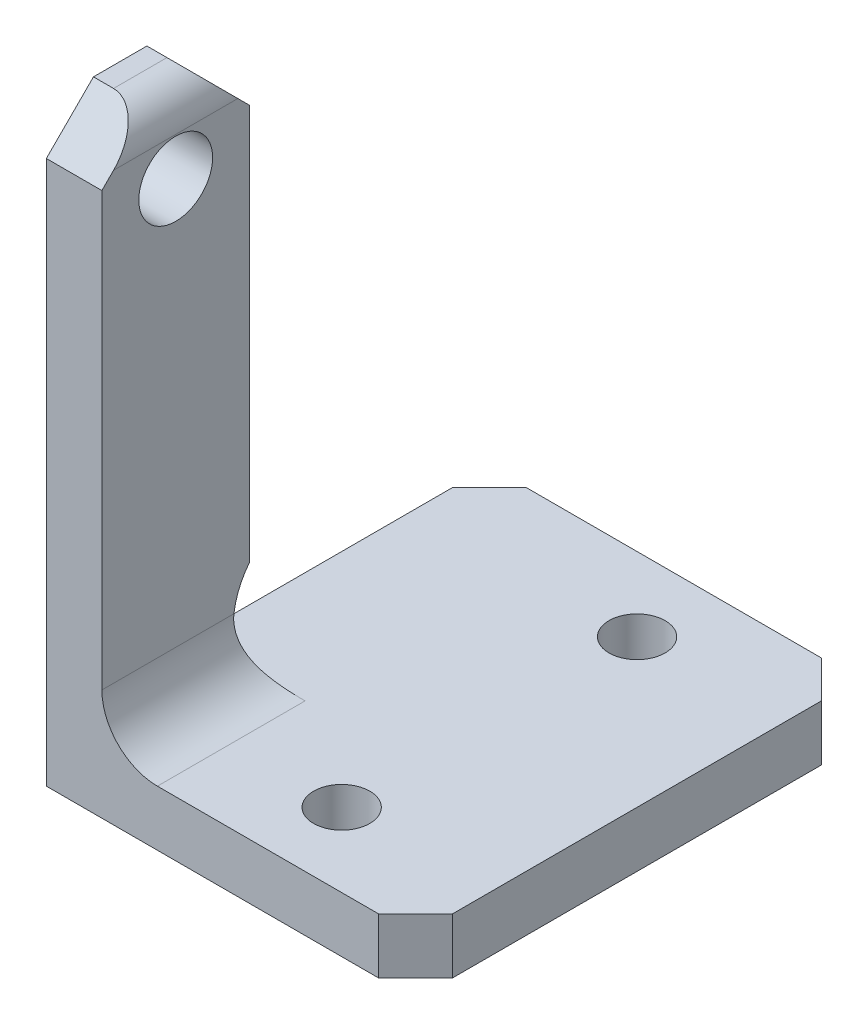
ISO-10303-21;
HEADER;
FILE_DESCRIPTION(('STEP AP214'),'2;1');
FILE_NAME('part.step','',(''),(''),'','','');
FILE_SCHEMA(('AUTOMOTIVE_DESIGN { 1 0 10303 214 1 1 1 1 }'));
ENDSEC;
DATA;
#1=APPLICATION_CONTEXT('core data for automotive mechanical design processes');
#2=APPLICATION_PROTOCOL_DEFINITION('international standard','automotive_design',2000,#1);
#3=PRODUCT_CONTEXT('',#1,'mechanical');
#4=PRODUCT('Part','Part','',(#3));
#5=PRODUCT_RELATED_PRODUCT_CATEGORY('part','',(#4));
#6=PRODUCT_DEFINITION_FORMATION('','',#4);
#7=PRODUCT_DEFINITION_CONTEXT('part definition',#1,'design');
#8=PRODUCT_DEFINITION('design','',#6,#7);
#9=PRODUCT_DEFINITION_SHAPE('','',#8);
#10=(LENGTH_UNIT() NAMED_UNIT(*) SI_UNIT(.MILLI.,.METRE.));
#11=(NAMED_UNIT(*) PLANE_ANGLE_UNIT() SI_UNIT($,.RADIAN.));
#12=(NAMED_UNIT(*) SI_UNIT($,.STERADIAN.) SOLID_ANGLE_UNIT());
#13=UNCERTAINTY_MEASURE_WITH_UNIT(LENGTH_MEASURE(1.E-05),#10,'distance_accuracy_value','');
#14=(GEOMETRIC_REPRESENTATION_CONTEXT(3) GLOBAL_UNCERTAINTY_ASSIGNED_CONTEXT((#13)) GLOBAL_UNIT_ASSIGNED_CONTEXT((#10,
#11,#12)) REPRESENTATION_CONTEXT('',''));
#15=CARTESIAN_POINT('',(0.,0.,0.));
#16=DIRECTION('',(0.,0.,1.));
#17=DIRECTION('',(1.,0.,0.));
#18=AXIS2_PLACEMENT_3D('',#15,#16,#17);
#19=CARTESIAN_POINT('',(-2.81025203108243E-13,0.,38.100000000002));
#20=DIRECTION('',(0.,1.,0.));
#21=DIRECTION('',(0.,0.,1.00000000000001));
#22=AXIS2_PLACEMENT_3D('',#19,#20,#21);
#23=PLANE('',#22);
#24=CARTESIAN_POINT('',(19.05,3.05311331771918E-13,31.7500000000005));
#25=DIRECTION('',(0.,1.,0.));
#26=DIRECTION('',(0.,0.,1.00000000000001));
#27=AXIS2_PLACEMENT_3D('',#24,#25,#26);
#28=CIRCLE('',#27,2.413);
#29=CARTESIAN_POINT('',(19.05,3.01797798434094E-13,34.1630000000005));
#30=VERTEX_POINT('',#29);
#31=EDGE_CURVE('E172',#30,#30,#28,.T.);
#32=ORIENTED_EDGE('',*,*,#31,.T.);
#33=EDGE_LOOP('',(#32));
#34=FACE_BOUND('',#33,.T.);
#35=CARTESIAN_POINT('',(19.0500000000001,0.,6.35000000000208));
#36=DIRECTION('',(0.,1.,0.));
#37=DIRECTION('',(0.,0.,1.00000000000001));
#38=AXIS2_PLACEMENT_3D('',#35,#36,#37);
#39=CIRCLE('',#38,2.413);
#40=CARTESIAN_POINT('',(19.0500000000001,0.,8.7630000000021));
#41=VERTEX_POINT('',#40);
#42=EDGE_CURVE('E178',#41,#41,#39,.T.);
#43=ORIENTED_EDGE('',*,*,#42,.T.);
#44=EDGE_LOOP('',(#43));
#45=FACE_BOUND('',#44,.T.);
#46=DIRECTION('',(0.,0.,-1.00000000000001));
#47=VECTOR('',#46,1.);
#48=CARTESIAN_POINT('',(-2.81025203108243E-13,0.,38.100000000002));
#49=LINE('',#48,#47);
#50=CARTESIAN_POINT('',(-2.81025203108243E-13,0.,38.100000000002));
#51=VERTEX_POINT('',#50);
#52=CARTESIAN_POINT('',(0.,-1.66533453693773E-13,3.17499999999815));
#53=VERTEX_POINT('',#52);
#54=EDGE_CURVE('E198',#51,#53,#49,.T.);
#55=ORIENTED_EDGE('',*,*,#54,.T.);
#56=DIRECTION('',(0.707106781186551,0.,-0.707106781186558));
#57=VECTOR('',#56,1.);
#58=CARTESIAN_POINT('',(0.,-1.66533453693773E-13,3.17499999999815));
#59=LINE('',#58,#57);
#60=CARTESIAN_POINT('',(3.17499999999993,0.,1.4432899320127E-12));
#61=VERTEX_POINT('',#60);
#62=EDGE_CURVE('E242',#53,#61,#59,.T.);
#63=ORIENTED_EDGE('',*,*,#62,.T.);
#64=DIRECTION('',(1.00000000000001,0.,0.));
#65=VECTOR('',#64,1.);
#66=CARTESIAN_POINT('',(0.,0.,1.11022302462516E-12));
#67=LINE('',#66,#65);
#68=CARTESIAN_POINT('',(28.575,1.11022302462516E-13,2.1094237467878E-12));
#69=VERTEX_POINT('',#68);
#70=EDGE_CURVE('E181',#61,#69,#67,.T.);
#71=ORIENTED_EDGE('',*,*,#70,.T.);
#72=DIRECTION('',(0.707106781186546,0.,0.707106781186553));
#73=VECTOR('',#72,1.);
#74=CARTESIAN_POINT('',(31.7500000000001,1.11022302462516E-13,3.17500000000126));
#75=LINE('',#74,#73);
#76=CARTESIAN_POINT('',(31.7500000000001,1.11022302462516E-13,3.17500000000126));
#77=VERTEX_POINT('',#76);
#78=EDGE_CURVE('E234',#69,#77,#75,.T.);
#79=ORIENTED_EDGE('',*,*,#78,.T.);
#80=DIRECTION('',(0.,0.,-1.00000000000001));
#81=VECTOR('',#80,1.);
#82=CARTESIAN_POINT('',(31.75,0.,38.1000000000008));
#83=LINE('',#82,#81);
#84=CARTESIAN_POINT('',(31.7499999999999,-1.11022302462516E-13,34.9250000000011));
#85=VERTEX_POINT('',#84);
#86=EDGE_CURVE('E217',#85,#77,#83,.T.);
#87=ORIENTED_EDGE('',*,*,#86,.F.);
#88=DIRECTION('',(0.707106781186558,0.,-0.707106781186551));
#89=VECTOR('',#88,1.);
#90=CARTESIAN_POINT('',(28.5749999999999,2.77555756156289E-13,38.1));
#91=LINE('',#90,#89);
#92=CARTESIAN_POINT('',(28.5749999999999,2.77555756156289E-13,38.1));
#93=VERTEX_POINT('',#92);
#94=EDGE_CURVE('E232',#85,#93,#91,.F.);
#95=ORIENTED_EDGE('',*,*,#94,.T.);
#96=DIRECTION('',(1.00000000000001,0.,0.));
#97=VECTOR('',#96,1.);
#98=CARTESIAN_POINT('',(-2.81025203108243E-13,0.,38.100000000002));
#99=LINE('',#98,#97);
#100=EDGE_CURVE('E186',#51,#93,#99,.T.);
#101=ORIENTED_EDGE('',*,*,#100,.F.);
#102=EDGE_LOOP('',(#55,#63,#71,#79,#87,#95,#101));
#103=FACE_BOUND('',#102,.T.);
#104=ADVANCED_FACE('F32',(#34,#45,#103),#23,.F.);
#105=CARTESIAN_POINT('',(31.75,4.77520000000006,38.1000000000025));
#106=DIRECTION('',(-1.00000000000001,0.,0.));
#107=DIRECTION('',(0.,0.,1.00000000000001));
#108=AXIS2_PLACEMENT_3D('',#105,#106,#107);
#109=PLANE('',#108);
#110=ORIENTED_EDGE('',*,*,#86,.T.);
#111=DIRECTION('',(0.,1.,0.));
#112=VECTOR('',#111,1.);
#113=CARTESIAN_POINT('',(31.7500000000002,4.77520000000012,3.17500000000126));
#114=LINE('',#113,#112);
#115=CARTESIAN_POINT('',(31.7500000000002,4.77520000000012,3.17500000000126));
#116=VERTEX_POINT('',#115);
#117=EDGE_CURVE('E222',#77,#116,#114,.T.);
#118=ORIENTED_EDGE('',*,*,#117,.T.);
#119=DIRECTION('',(0.,0.,-1.00000000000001));
#120=VECTOR('',#119,1.);
#121=CARTESIAN_POINT('',(31.75,4.77520000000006,38.1000000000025));
#122=LINE('',#121,#120);
#123=CARTESIAN_POINT('',(31.7500000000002,4.7751999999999,34.9250000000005));
#124=VERTEX_POINT('',#123);
#125=EDGE_CURVE('E215',#124,#116,#122,.T.);
#126=ORIENTED_EDGE('',*,*,#125,.F.);
#127=DIRECTION('',(0.,-1.,0.));
#128=VECTOR('',#127,1.);
#129=CARTESIAN_POINT('',(31.7500000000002,4.7751999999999,34.9250000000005));
#130=LINE('',#129,#128);
#131=EDGE_CURVE('E220',#124,#85,#130,.T.);
#132=ORIENTED_EDGE('',*,*,#131,.T.);
#133=EDGE_LOOP('',(#110,#118,#126,#132));
#134=FACE_BOUND('',#133,.T.);
#135=ADVANCED_FACE('F273',(#134),#109,.F.);
#136=CARTESIAN_POINT('',(9.55039999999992,4.7752000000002,38.0999999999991));
#137=DIRECTION('',(0.,-1.,0.));
#138=DIRECTION('',(0.,0.,-1.00000000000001));
#139=AXIS2_PLACEMENT_3D('',#136,#137,#138);
#140=PLANE('',#139);
#141=DIRECTION('',(1.00000000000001,0.,0.));
#142=VECTOR('',#141,1.);
#143=CARTESIAN_POINT('',(-1.49186218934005E-13,4.77519999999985,25.4000000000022));
#144=LINE('',#143,#142);
#145=CARTESIAN_POINT('',(0.,4.77519999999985,25.4000000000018));
#146=VERTEX_POINT('',#145);
#147=CARTESIAN_POINT('',(9.55039999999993,4.77520000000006,25.4000000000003));
#148=VERTEX_POINT('',#147);
#149=EDGE_CURVE('E142',#146,#148,#144,.T.);
#150=ORIENTED_EDGE('',*,*,#149,.T.);
#151=DIRECTION('',(0.,0.,-1.00000000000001));
#152=VECTOR('',#151,1.);
#153=CARTESIAN_POINT('',(9.55039999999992,4.7752000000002,38.0999999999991));
#154=LINE('',#153,#152);
#155=CARTESIAN_POINT('',(9.55039999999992,4.7752000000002,38.0999999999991));
#156=VERTEX_POINT('',#155);
#157=EDGE_CURVE('E212',#156,#148,#154,.T.);
#158=ORIENTED_EDGE('',*,*,#157,.F.);
#159=DIRECTION('',(-1.00000000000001,0.,0.));
#160=VECTOR('',#159,1.);
#161=CARTESIAN_POINT('',(9.55039999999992,4.7752000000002,38.0999999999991));
#162=LINE('',#161,#160);
#163=CARTESIAN_POINT('',(28.5749999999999,4.77520000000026,38.1000000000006));
#164=VERTEX_POINT('',#163);
#165=EDGE_CURVE('E189',#164,#156,#162,.T.);
#166=ORIENTED_EDGE('',*,*,#165,.F.);
#167=DIRECTION('',(-0.707106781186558,0.,0.707106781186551));
#168=VECTOR('',#167,1.);
#169=CARTESIAN_POINT('',(28.5749999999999,4.77520000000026,38.1000000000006));
#170=LINE('',#169,#168);
#171=EDGE_CURVE('E225',#164,#124,#170,.F.);
#172=ORIENTED_EDGE('',*,*,#171,.T.);
#173=ORIENTED_EDGE('',*,*,#125,.T.);
#174=DIRECTION('',(-0.707106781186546,0.,-0.707106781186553));
#175=VECTOR('',#174,1.);
#176=CARTESIAN_POINT('',(31.7500000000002,4.77520000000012,3.17500000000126));
#177=LINE('',#176,#175);
#178=CARTESIAN_POINT('',(28.5750000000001,4.77520000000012,2.33146835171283E-12));
#179=VERTEX_POINT('',#178);
#180=EDGE_CURVE('E227',#116,#179,#177,.T.);
#181=ORIENTED_EDGE('',*,*,#180,.T.);
#182=DIRECTION('',(-1.00000000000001,0.,0.));
#183=VECTOR('',#182,1.);
#184=CARTESIAN_POINT('',(9.55040000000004,4.77520000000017,1.55431223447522E-12));
#185=LINE('',#184,#183);
#186=CARTESIAN_POINT('',(3.17499999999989,4.77520000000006,1.11022302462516E-12));
#187=VERTEX_POINT('',#186);
#188=EDGE_CURVE('E183',#179,#187,#185,.T.);
#189=ORIENTED_EDGE('',*,*,#188,.T.);
#190=DIRECTION('',(-0.707106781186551,0.,0.707106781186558));
#191=VECTOR('',#190,1.);
#192=CARTESIAN_POINT('',(-1.38777878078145E-13,4.77520000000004,3.17500000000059));
#193=LINE('',#192,#191);
#194=CARTESIAN_POINT('',(-1.38777878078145E-13,4.77520000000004,3.17500000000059));
#195=VERTEX_POINT('',#194);
#196=EDGE_CURVE('E246',#187,#195,#193,.T.);
#197=ORIENTED_EDGE('',*,*,#196,.T.);
#198=DIRECTION('',(0.,0.,-1.00000000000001));
#199=VECTOR('',#198,1.);
#200=CARTESIAN_POINT('',(-1.49186218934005E-13,4.77519999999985,25.4000000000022));
#201=LINE('',#200,#199);
#202=EDGE_CURVE('E158',#146,#195,#201,.T.);
#203=ORIENTED_EDGE('',*,*,#202,.F.);
#204=EDGE_LOOP('',(#150,#158,#166,#172,#173,#181,#189,#197,#203));
#205=FACE_BOUND('',#204,.T.);
#206=CARTESIAN_POINT('',(19.05,4.77520000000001,6.3500000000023));
#207=DIRECTION('',(0.,1.,0.));
#208=DIRECTION('',(0.,0.,1.00000000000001));
#209=AXIS2_PLACEMENT_3D('',#206,#207,#208);
#210=CIRCLE('',#209,2.413);
#211=CARTESIAN_POINT('',(19.05,4.7752,8.76300000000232));
#212=VERTEX_POINT('',#211);
#213=EDGE_CURVE('E175',#212,#212,#210,.T.);
#214=ORIENTED_EDGE('',*,*,#213,.F.);
#215=EDGE_LOOP('',(#214));
#216=FACE_BOUND('',#215,.T.);
#217=CARTESIAN_POINT('',(19.0499999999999,4.77520000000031,31.7500000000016));
#218=DIRECTION('',(0.,1.,0.));
#219=DIRECTION('',(0.,0.,1.00000000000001));
#220=AXIS2_PLACEMENT_3D('',#217,#218,#219);
#221=CIRCLE('',#220,2.413);
#222=CARTESIAN_POINT('',(19.0499999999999,4.77520000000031,34.1630000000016));
#223=VERTEX_POINT('',#222);
#224=EDGE_CURVE('E169',#223,#223,#221,.T.);
#225=ORIENTED_EDGE('',*,*,#224,.F.);
#226=EDGE_LOOP('',(#225));
#227=FACE_BOUND('',#226,.T.);
#228=ADVANCED_FACE('F268',(#205,#216,#227),#140,.F.);
#229=CARTESIAN_POINT('',(9.55039999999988,9.55040000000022,38.0999999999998));
#230=DIRECTION('',(0.,0.,-1.00000000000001));
#231=DIRECTION('',(-1.00000000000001,0.,0.));
#232=AXIS2_PLACEMENT_3D('',#229,#230,#231);
#233=CYLINDRICAL_SURFACE('',#232,4.7752);
#234=ORIENTED_EDGE('',*,*,#157,.T.);
#235=CARTESIAN_POINT('',(9.55040000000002,4.77520000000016,25.4000000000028));
#236=CARTESIAN_POINT('',(9.42981359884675,4.77517118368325,25.3999359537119));
#237=CARTESIAN_POINT('',(9.30926475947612,4.77976641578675,25.4036554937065));
#238=CARTESIAN_POINT('',(9.06942006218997,4.79797262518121,25.4181715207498));
#239=CARTESIAN_POINT('',(8.95012286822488,4.81157272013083,25.4289594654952));
#240=CARTESIAN_POINT('',(8.71473657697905,4.84739399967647,25.4569964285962));
#241=CARTESIAN_POINT('',(8.59862818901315,4.8695358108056,25.474185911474));
#242=CARTESIAN_POINT('',(8.36929763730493,4.92207582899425,25.5142134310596));
#243=CARTESIAN_POINT('',(8.25607623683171,4.95247619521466,25.537052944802));
#244=CARTESIAN_POINT('',(7.92275756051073,5.05516595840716,25.6124196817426));
#245=CARTESIAN_POINT('',(7.70773500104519,5.13914358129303,25.6719641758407));
#246=CARTESIAN_POINT('',(7.29429624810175,5.33551961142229,25.8020432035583));
#247=CARTESIAN_POINT('',(7.09592810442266,5.44799672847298,25.8726079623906));
#248=CARTESIAN_POINT('',(6.69144719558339,5.71689495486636,26.027537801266));
#249=CARTESIAN_POINT('',(6.48813400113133,5.8772625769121,26.1124523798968));
#250=CARTESIAN_POINT('',(6.20393205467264,6.141521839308,26.2360788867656));
#251=CARTESIAN_POINT('',(6.11262332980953,6.23360588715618,26.2766807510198));
#252=CARTESIAN_POINT('',(5.93731305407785,6.4254969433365,26.3555637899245));
#253=CARTESIAN_POINT('',(5.85331283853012,6.52530535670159,26.393844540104));
#254=CARTESIAN_POINT('',(5.6867555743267,6.74063476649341,26.4699143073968));
#255=CARTESIAN_POINT('',(5.60486284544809,6.85677374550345,26.5074139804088));
#256=CARTESIAN_POINT('',(5.45116876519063,7.09700364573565,26.5770113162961));
#257=CARTESIAN_POINT('',(5.3793618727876,7.22109014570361,26.6091119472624));
#258=CARTESIAN_POINT('',(5.24680805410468,7.4762129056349,26.6665690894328));
#259=CARTESIAN_POINT('',(5.18603903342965,7.60723458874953,26.6919391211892));
#260=CARTESIAN_POINT('',(5.07628434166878,7.87535160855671,26.7348090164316));
#261=CARTESIAN_POINT('',(5.02729485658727,8.01244496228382,26.7523114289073));
#262=CARTESIAN_POINT('',(4.95013387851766,8.26434610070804,26.7759036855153));
#263=CARTESIAN_POINT('',(4.9197689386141,8.37834221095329,26.7835451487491));
#264=CARTESIAN_POINT('',(4.86752994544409,8.60849536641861,26.7926322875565));
#265=CARTESIAN_POINT('',(4.84565407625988,8.72465194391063,26.7940792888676));
#266=CARTESIAN_POINT('',(4.81047205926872,8.95901143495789,26.7904775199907));
#267=CARTESIAN_POINT('',(4.79722861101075,9.07722305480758,26.785382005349));
#268=CARTESIAN_POINT('',(4.77957548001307,9.31389942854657,26.7685244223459));
#269=CARTESIAN_POINT('',(4.77517095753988,9.43236428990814,26.7567584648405));
#270=CARTESIAN_POINT('',(4.77519999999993,9.55040000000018,26.7416150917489));
#271=B_SPLINE_CURVE_WITH_KNOTS('',3,(#235,#236,#237,#238,#239,#240,#241,#242,#243,#244,#245,
#246,#247,#248,#249,#250,#251,#252,#253,#254,#255,#256,#257,#258,#259,#260,#261,#262,#263,#264,
#265,#266,#267,#268,#269,#270),.UNSPECIFIED.,.F.,.F.,(4,2,2,2,2,2,2,2,2,2,2,2,2,2,2,2,2,4),(0.,
0.361553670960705,0.722671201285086,1.08051089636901,1.43844423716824,2.1504675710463,
2.86447922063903,3.67838977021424,4.08570819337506,4.49310088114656,4.93339203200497,
5.37344033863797,5.81259785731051,6.25161299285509,6.60580944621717,6.95993009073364,
7.31659496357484,7.6734680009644),.UNSPECIFIED.);
#272=CARTESIAN_POINT('',(4.77519999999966,9.5504000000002,26.741615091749));
#273=VERTEX_POINT('',#272);
#274=EDGE_CURVE('E292',#148,#273,#271,.T.);
#275=ORIENTED_EDGE('',*,*,#274,.T.);
#276=DIRECTION('',(0.,0.,-1.00000000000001));
#277=VECTOR('',#276,1.);
#278=CARTESIAN_POINT('',(4.77519999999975,9.55040000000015,38.1000000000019));
#279=LINE('',#278,#277);
#280=CARTESIAN_POINT('',(4.77519999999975,9.55040000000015,38.1000000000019));
#281=VERTEX_POINT('',#280);
#282=EDGE_CURVE('E209',#281,#273,#279,.T.);
#283=ORIENTED_EDGE('',*,*,#282,.F.);
#284=CARTESIAN_POINT('',(9.55039999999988,9.55040000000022,38.0999999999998));
#285=DIRECTION('',(0.,0.,-1.00000000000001));
#286=DIRECTION('',(-1.00000000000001,0.,0.));
#287=AXIS2_PLACEMENT_3D('',#284,#285,#286);
#288=CIRCLE('',#287,4.7752);
#289=EDGE_CURVE('E191',#156,#281,#288,.T.);
#290=ORIENTED_EDGE('',*,*,#289,.F.);
#291=EDGE_LOOP('',(#234,#275,#283,#290));
#292=FACE_BOUND('',#291,.T.);
#293=ADVANCED_FACE('F290',(#292),#233,.F.);
#294=CARTESIAN_POINT('',(4.77519999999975,9.55040000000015,38.1000000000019));
#295=DIRECTION('',(-1.00000000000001,0.,0.));
#296=DIRECTION('',(0.,0.,1.00000000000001));
#297=AXIS2_PLACEMENT_3D('',#294,#295,#296);
#298=PLANE('',#297);
#299=CARTESIAN_POINT('',(4.77519999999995,44.45,31.7500000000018));
#300=DIRECTION('',(-1.00000000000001,0.,0.));
#301=DIRECTION('',(0.,0.,1.00000000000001));
#302=AXIS2_PLACEMENT_3D('',#299,#300,#301);
#303=CIRCLE('',#302,3.175);
#304=CARTESIAN_POINT('',(4.77519999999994,44.45,34.9250000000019));
#305=VERTEX_POINT('',#304);
#306=EDGE_CURVE('E159',#305,#305,#303,.T.);
#307=ORIENTED_EDGE('',*,*,#306,.T.);
#308=EDGE_LOOP('',(#307));
#309=FACE_BOUND('',#308,.T.);
#310=ORIENTED_EDGE('',*,*,#282,.T.);
#311=CARTESIAN_POINT('',(4.77519999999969,8.74394999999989,20.4430328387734));
#312=DIRECTION('',(-1.00000000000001,0.,0.));
#313=DIRECTION('',(0.,0.,1.));
#314=AXIS2_PLACEMENT_3D('',#311,#312,#313);
#315=CIRCLE('',#314,6.35);
#316=CARTESIAN_POINT('',(4.77519999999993,12.7126999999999,25.4000000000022));
#317=VERTEX_POINT('',#316);
#318=EDGE_CURVE('E147',#273,#317,#315,.T.);
#319=ORIENTED_EDGE('',*,*,#318,.T.);
#320=DIRECTION('',(0.,1.,0.));
#321=VECTOR('',#320,1.);
#322=CARTESIAN_POINT('',(4.77519999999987,9.55039999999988,25.4000000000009));
#323=LINE('',#322,#321);
#324=CARTESIAN_POINT('',(4.77519999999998,46.7473224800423,25.4000000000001));
#325=VERTEX_POINT('',#324);
#326=EDGE_CURVE('E54',#317,#325,#323,.T.);
#327=ORIENTED_EDGE('',*,*,#326,.T.);
#328=DIRECTION('',(0.,0.707106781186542,0.707106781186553));
#329=VECTOR('',#328,1.);
#330=CARTESIAN_POINT('',(4.77519999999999,34.4988612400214,13.151538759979));
#331=LINE('',#330,#329);
#332=CARTESIAN_POINT('',(4.7752,47.7520000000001,26.404677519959));
#333=VERTEX_POINT('',#332);
#334=EDGE_CURVE('E371',#325,#333,#331,.T.);
#335=ORIENTED_EDGE('',*,*,#334,.T.);
#336=DIRECTION('',(0.,0.,-1.00000000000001));
#337=VECTOR('',#336,1.);
#338=CARTESIAN_POINT('',(4.7752,47.752,38.0999999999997));
#339=LINE('',#338,#337);
#340=CARTESIAN_POINT('',(4.77519999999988,47.752,37.0953224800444));
#341=VERTEX_POINT('',#340);
#342=EDGE_CURVE('E206',#341,#333,#339,.T.);
#343=ORIENTED_EDGE('',*,*,#342,.F.);
#344=DIRECTION('',(0.,-0.707106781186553,0.707106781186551));
#345=VECTOR('',#344,1.);
#346=CARTESIAN_POINT('',(4.7751999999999,28.1488612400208,56.6984612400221));
#347=LINE('',#346,#345);
#348=CARTESIAN_POINT('',(4.77520000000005,46.7473224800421,38.1000000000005));
#349=VERTEX_POINT('',#348);
#350=EDGE_CURVE('E295',#341,#349,#347,.T.);
#351=ORIENTED_EDGE('',*,*,#350,.T.);
#352=DIRECTION('',(0.,1.,0.));
#353=VECTOR('',#352,1.);
#354=CARTESIAN_POINT('',(4.77519999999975,9.55040000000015,38.1000000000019));
#355=LINE('',#354,#353);
#356=EDGE_CURVE('E193',#281,#349,#355,.T.);
#357=ORIENTED_EDGE('',*,*,#356,.F.);
#358=EDGE_LOOP('',(#310,#319,#327,#335,#343,#351,#357));
#359=FACE_BOUND('',#358,.T.);
#360=ADVANCED_FACE('F293',(#309,#359),#298,.F.);
#361=CARTESIAN_POINT('',(1.72719999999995,47.752,38.1000000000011));
#362=DIRECTION('',(0.,0.,-1.00000000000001));
#363=DIRECTION('',(-1.00000000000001,0.,0.));
#364=AXIS2_PLACEMENT_3D('',#361,#362,#363);
#365=CYLINDRICAL_SURFACE('',#364,3.048);
#366=DIRECTION('',(0.,0.,-1.00000000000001));
#367=VECTOR('',#366,1.);
#368=CARTESIAN_POINT('',(1.72719999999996,50.8,38.1000000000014));
#369=LINE('',#368,#367);
#370=CARTESIAN_POINT('',(1.72719999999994,50.8000000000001,34.0473224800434));
#371=VERTEX_POINT('',#370);
#372=CARTESIAN_POINT('',(1.72719999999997,50.8000000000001,29.4526775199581));
#373=VERTEX_POINT('',#372);
#374=EDGE_CURVE('E203',#371,#373,#369,.T.);
#375=ORIENTED_EDGE('',*,*,#374,.F.);
#376=CARTESIAN_POINT('',(1.72719999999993,47.7520000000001,37.0953224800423));
#377=DIRECTION('',(0.,-0.707106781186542,-0.707106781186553));
#378=DIRECTION('',(0.,0.707106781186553,-0.707106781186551));
#379=AXIS2_PLACEMENT_3D('',#376,#377,#378);
#380=ELLIPSE('',#379,4.31052293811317,3.048);
#381=EDGE_CURVE('E297',#371,#341,#380,.T.);
#382=ORIENTED_EDGE('',*,*,#381,.T.);
#383=ORIENTED_EDGE('',*,*,#342,.T.);
#384=CARTESIAN_POINT('',(1.72719999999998,47.7520000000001,26.4046775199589));
#385=DIRECTION('',(0.,-0.707106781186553,0.707106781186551));
#386=DIRECTION('',(0.,-0.707106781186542,-0.707106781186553));
#387=AXIS2_PLACEMENT_3D('',#384,#385,#386);
#388=ELLIPSE('',#387,4.31052293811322,3.048);
#389=EDGE_CURVE('E303',#333,#373,#388,.T.);
#390=ORIENTED_EDGE('',*,*,#389,.T.);
#391=EDGE_LOOP('',(#375,#382,#383,#390));
#392=FACE_BOUND('',#391,.T.);
#393=ADVANCED_FACE('F319',(#392),#365,.T.);
#394=CARTESIAN_POINT('',(0.,50.7999999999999,38.1000000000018));
#395=DIRECTION('',(0.,-1.,0.));
#396=DIRECTION('',(0.,0.,-1.00000000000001));
#397=AXIS2_PLACEMENT_3D('',#394,#395,#396);
#398=PLANE('',#397);
#399=DIRECTION('',(0.,0.,-1.00000000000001));
#400=VECTOR('',#399,1.);
#401=CARTESIAN_POINT('',(0.,50.7999999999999,38.1000000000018));
#402=LINE('',#401,#400);
#403=CARTESIAN_POINT('',(0.,50.8,34.0473224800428));
#404=VERTEX_POINT('',#403);
#405=CARTESIAN_POINT('',(0.,50.8,29.4526775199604));
#406=VERTEX_POINT('',#405);
#407=EDGE_CURVE('E201',#404,#406,#402,.T.);
#408=ORIENTED_EDGE('',*,*,#407,.F.);
#409=DIRECTION('',(1.00000000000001,0.,0.));
#410=VECTOR('',#409,1.);
#411=CARTESIAN_POINT('',(0.,50.8,34.0473224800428));
#412=LINE('',#411,#410);
#413=EDGE_CURVE('E300',#404,#371,#412,.T.);
#414=ORIENTED_EDGE('',*,*,#413,.T.);
#415=ORIENTED_EDGE('',*,*,#374,.T.);
#416=DIRECTION('',(-1.00000000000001,0.,0.));
#417=VECTOR('',#416,1.);
#418=CARTESIAN_POINT('',(0.,50.8,29.4526775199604));
#419=LINE('',#418,#417);
#420=EDGE_CURVE('E298',#373,#406,#419,.T.);
#421=ORIENTED_EDGE('',*,*,#420,.T.);
#422=EDGE_LOOP('',(#408,#414,#415,#421));
#423=FACE_BOUND('',#422,.T.);
#424=ADVANCED_FACE('F325',(#423),#398,.F.);
#425=CARTESIAN_POINT('',(-2.81025203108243E-13,0.,38.100000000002));
#426=DIRECTION('',(1.00000000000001,0.,0.));
#427=DIRECTION('',(0.,0.,-1.00000000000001));
#428=AXIS2_PLACEMENT_3D('',#425,#426,#427);
#429=PLANE('',#428);
#430=CARTESIAN_POINT('',(0.,44.45,31.7500000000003));
#431=DIRECTION('',(1.00000000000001,0.,0.));
#432=DIRECTION('',(0.,0.,-1.00000000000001));
#433=AXIS2_PLACEMENT_3D('',#430,#431,#432);
#434=CIRCLE('',#433,3.175);
#435=CARTESIAN_POINT('',(0.,44.45,28.5750000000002));
#436=VERTEX_POINT('',#435);
#437=EDGE_CURVE('E163',#436,#436,#434,.T.);
#438=ORIENTED_EDGE('',*,*,#437,.T.);
#439=EDGE_LOOP('',(#438));
#440=FACE_BOUND('',#439,.T.);
#441=DIRECTION('',(0.,-1.,0.));
#442=VECTOR('',#441,1.);
#443=CARTESIAN_POINT('',(-1.49186218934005E-13,4.77519999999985,25.4000000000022));
#444=LINE('',#443,#442);
#445=CARTESIAN_POINT('',(0.,46.7473224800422,25.4000000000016));
#446=VERTEX_POINT('',#445);
#447=CARTESIAN_POINT('',(0.,12.7126999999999,25.4000000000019));
#448=VERTEX_POINT('',#447);
#449=EDGE_CURVE('E153',#446,#448,#444,.T.);
#450=ORIENTED_EDGE('',*,*,#449,.T.);
#451=CARTESIAN_POINT('',(0.,8.74394999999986,20.443032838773));
#452=DIRECTION('',(-1.,0.,0.));
#453=DIRECTION('',(0.,0.,-1.));
#454=AXIS2_PLACEMENT_3D('',#451,#452,#453);
#455=CIRCLE('',#454,6.35);
#456=EDGE_CURVE('E139',#146,#448,#455,.T.);
#457=ORIENTED_EDGE('',*,*,#456,.F.);
#458=ORIENTED_EDGE('',*,*,#202,.T.);
#459=DIRECTION('',(0.,-1.,0.));
#460=VECTOR('',#459,1.);
#461=CARTESIAN_POINT('',(0.,-1.66533453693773E-13,3.17499999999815));
#462=LINE('',#461,#460);
#463=EDGE_CURVE('E239',#195,#53,#462,.T.);
#464=ORIENTED_EDGE('',*,*,#463,.T.);
#465=ORIENTED_EDGE('',*,*,#54,.F.);
#466=DIRECTION('',(0.,-1.,0.));
#467=VECTOR('',#466,1.);
#468=CARTESIAN_POINT('',(-2.81025203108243E-13,0.,38.100000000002));
#469=LINE('',#468,#467);
#470=CARTESIAN_POINT('',(0.,46.747322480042,38.1000000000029));
#471=VERTEX_POINT('',#470);
#472=EDGE_CURVE('E196',#471,#51,#469,.T.);
#473=ORIENTED_EDGE('',*,*,#472,.F.);
#474=DIRECTION('',(0.,-0.707106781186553,0.707106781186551));
#475=VECTOR('',#474,1.);
#476=CARTESIAN_POINT('',(0.,53.0973224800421,31.7500000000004));
#477=LINE('',#476,#475);
#478=EDGE_CURVE('E46',#404,#471,#477,.T.);
#479=ORIENTED_EDGE('',*,*,#478,.F.);
#480=ORIENTED_EDGE('',*,*,#407,.T.);
#481=DIRECTION('',(0.,0.707106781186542,0.707106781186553));
#482=VECTOR('',#481,1.);
#483=CARTESIAN_POINT('',(0.,45.683209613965,24.3358871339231));
#484=LINE('',#483,#482);
#485=EDGE_CURVE('E157',#446,#406,#484,.T.);
#486=ORIENTED_EDGE('',*,*,#485,.F.);
#487=EDGE_LOOP('',(#450,#457,#458,#464,#465,#473,#479,#480,#486));
#488=FACE_BOUND('',#487,.T.);
#489=ADVANCED_FACE('F155',(#440,#488),#429,.F.);
#490=CARTESIAN_POINT('',(9.55039999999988,9.55040000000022,38.0999999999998));
#491=DIRECTION('',(0.,0.,-1.00000000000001));
#492=DIRECTION('',(-1.00000000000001,0.,0.));
#493=AXIS2_PLACEMENT_3D('',#490,#491,#492);
#494=PLANE('',#493);
#495=ORIENTED_EDGE('',*,*,#356,.T.);
#496=DIRECTION('',(-1.00000000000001,0.,0.));
#497=VECTOR('',#496,1.);
#498=CARTESIAN_POINT('',(9.55040000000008,46.747322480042,38.0999999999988));
#499=LINE('',#498,#497);
#500=EDGE_CURVE('E39',#349,#471,#499,.T.);
#501=ORIENTED_EDGE('',*,*,#500,.T.);
#502=ORIENTED_EDGE('',*,*,#472,.T.);
#503=ORIENTED_EDGE('',*,*,#100,.T.);
#504=DIRECTION('',(0.,1.,0.));
#505=VECTOR('',#504,1.);
#506=CARTESIAN_POINT('',(28.5749999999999,9.55040000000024,38.1000000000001));
#507=LINE('',#506,#505);
#508=EDGE_CURVE('E236',#93,#164,#507,.T.);
#509=ORIENTED_EDGE('',*,*,#508,.T.);
#510=ORIENTED_EDGE('',*,*,#165,.T.);
#511=ORIENTED_EDGE('',*,*,#289,.T.);
#512=EDGE_LOOP('',(#495,#501,#502,#503,#509,#510,#511));
#513=FACE_BOUND('',#512,.T.);
#514=ADVANCED_FACE('F251',(#513),#494,.F.);
#515=CARTESIAN_POINT('',(9.5504,9.5504000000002,0.));
#516=DIRECTION('',(0.,0.,-1.00000000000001));
#517=DIRECTION('',(-1.00000000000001,0.,0.));
#518=AXIS2_PLACEMENT_3D('',#515,#516,#517);
#519=PLANE('',#518);
#520=ORIENTED_EDGE('',*,*,#70,.F.);
#521=DIRECTION('',(0.,1.,0.));
#522=VECTOR('',#521,1.);
#523=CARTESIAN_POINT('',(3.17499999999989,4.77520000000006,1.11022302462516E-12));
#524=LINE('',#523,#522);
#525=EDGE_CURVE('E244',#61,#187,#524,.T.);
#526=ORIENTED_EDGE('',*,*,#525,.T.);
#527=ORIENTED_EDGE('',*,*,#188,.F.);
#528=DIRECTION('',(0.,-1.,0.));
#529=VECTOR('',#528,1.);
#530=CARTESIAN_POINT('',(28.575,1.11022302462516E-13,2.1094237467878E-12));
#531=LINE('',#530,#529);
#532=EDGE_CURVE('E229',#179,#69,#531,.T.);
#533=ORIENTED_EDGE('',*,*,#532,.T.);
#534=EDGE_LOOP('',(#520,#526,#527,#533));
#535=FACE_BOUND('',#534,.T.);
#536=ADVANCED_FACE('F283',(#535),#519,.T.);
#537=CARTESIAN_POINT('',(19.0500000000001,0.,6.35000000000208));
#538=DIRECTION('',(0.,1.,0.));
#539=DIRECTION('',(0.,0.,1.00000000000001));
#540=AXIS2_PLACEMENT_3D('',#537,#538,#539);
#541=CYLINDRICAL_SURFACE('',#540,2.413);
#542=ORIENTED_EDGE('',*,*,#42,.F.);
#543=EDGE_LOOP('',(#542));
#544=FACE_BOUND('',#543,.T.);
#545=ORIENTED_EDGE('',*,*,#213,.T.);
#546=EDGE_LOOP('',(#545));
#547=FACE_BOUND('',#546,.T.);
#548=ADVANCED_FACE('F338',(#544,#547),#541,.F.);
#549=CARTESIAN_POINT('',(19.05,3.05311331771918E-13,31.7500000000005));
#550=DIRECTION('',(0.,1.,0.));
#551=DIRECTION('',(0.,0.,1.00000000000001));
#552=AXIS2_PLACEMENT_3D('',#549,#550,#551);
#553=CYLINDRICAL_SURFACE('',#552,2.413);
#554=ORIENTED_EDGE('',*,*,#31,.F.);
#555=EDGE_LOOP('',(#554));
#556=FACE_BOUND('',#555,.T.);
#557=ORIENTED_EDGE('',*,*,#224,.T.);
#558=EDGE_LOOP('',(#557));
#559=FACE_BOUND('',#558,.T.);
#560=ADVANCED_FACE('F341',(#556,#559),#553,.F.);
#561=CARTESIAN_POINT('',(-1.49186218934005E-13,4.77519999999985,25.4000000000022));
#562=DIRECTION('',(0.,0.,1.00000000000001));
#563=DIRECTION('',(1.00000000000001,0.,0.));
#564=AXIS2_PLACEMENT_3D('',#561,#562,#563);
#565=PLANE('',#564);
#566=ORIENTED_EDGE('',*,*,#326,.F.);
#567=DIRECTION('',(-1.,0.,0.));
#568=VECTOR('',#567,1.);
#569=CARTESIAN_POINT('',(31.7500000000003,12.7126999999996,25.4000000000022));
#570=LINE('',#569,#568);
#571=EDGE_CURVE('E11',#317,#448,#570,.T.);
#572=ORIENTED_EDGE('',*,*,#571,.T.);
#573=ORIENTED_EDGE('',*,*,#449,.F.);
#574=DIRECTION('',(1.00000000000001,0.,0.));
#575=VECTOR('',#574,1.);
#576=CARTESIAN_POINT('',(0.,46.7473224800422,25.4000000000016));
#577=LINE('',#576,#575);
#578=EDGE_CURVE('E248',#446,#325,#577,.T.);
#579=ORIENTED_EDGE('',*,*,#578,.T.);
#580=EDGE_LOOP('',(#566,#572,#573,#579));
#581=FACE_BOUND('',#580,.T.);
#582=ADVANCED_FACE('F151',(#581),#565,.F.);
#583=CARTESIAN_POINT('',(0.,44.45,31.7500000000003));
#584=DIRECTION('',(1.00000000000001,0.,0.));
#585=DIRECTION('',(0.,0.,-1.00000000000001));
#586=AXIS2_PLACEMENT_3D('',#583,#584,#585);
#587=CYLINDRICAL_SURFACE('',#586,3.175);
#588=ORIENTED_EDGE('',*,*,#437,.F.);
#589=EDGE_LOOP('',(#588));
#590=FACE_BOUND('',#589,.T.);
#591=ORIENTED_EDGE('',*,*,#306,.F.);
#592=EDGE_LOOP('',(#591));
#593=FACE_BOUND('',#592,.T.);
#594=ADVANCED_FACE('F312',(#590,#593),#587,.F.);
#595=CARTESIAN_POINT('',(31.7500000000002,4.77520000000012,3.17500000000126));
#596=DIRECTION('',(0.707106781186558,0.,-0.707106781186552));
#597=DIRECTION('',(-0.707106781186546,0.,-0.707106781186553));
#598=AXIS2_PLACEMENT_3D('',#595,#596,#597);
#599=PLANE('',#598);
#600=ORIENTED_EDGE('',*,*,#78,.F.);
#601=ORIENTED_EDGE('',*,*,#532,.F.);
#602=ORIENTED_EDGE('',*,*,#180,.F.);
#603=ORIENTED_EDGE('',*,*,#117,.F.);
#604=EDGE_LOOP('',(#600,#601,#602,#603));
#605=FACE_BOUND('',#604,.T.);
#606=ADVANCED_FACE('F277',(#605),#599,.T.);
#607=CARTESIAN_POINT('',(28.5749999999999,9.55040000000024,38.1000000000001));
#608=DIRECTION('',(-0.707106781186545,0.,-0.707106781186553));
#609=DIRECTION('',(-0.707106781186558,0.,0.707106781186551));
#610=AXIS2_PLACEMENT_3D('',#607,#608,#609);
#611=PLANE('',#610);
#612=ORIENTED_EDGE('',*,*,#94,.F.);
#613=ORIENTED_EDGE('',*,*,#131,.F.);
#614=ORIENTED_EDGE('',*,*,#171,.F.);
#615=ORIENTED_EDGE('',*,*,#508,.F.);
#616=EDGE_LOOP('',(#612,#613,#614,#615));
#617=FACE_BOUND('',#616,.T.);
#618=ADVANCED_FACE('F264',(#617),#611,.F.);
#619=CARTESIAN_POINT('',(0.,-1.66533453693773E-13,3.17499999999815));
#620=DIRECTION('',(-0.707106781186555,0.,-0.707106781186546));
#621=DIRECTION('',(-0.707106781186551,0.,0.707106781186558));
#622=AXIS2_PLACEMENT_3D('',#619,#620,#621);
#623=PLANE('',#622);
#624=ORIENTED_EDGE('',*,*,#196,.F.);
#625=ORIENTED_EDGE('',*,*,#525,.F.);
#626=ORIENTED_EDGE('',*,*,#62,.F.);
#627=ORIENTED_EDGE('',*,*,#463,.F.);
#628=EDGE_LOOP('',(#624,#625,#626,#627));
#629=FACE_BOUND('',#628,.T.);
#630=ADVANCED_FACE('F286',(#629),#623,.T.);
#631=CARTESIAN_POINT('',(31.7500000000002,45.6832096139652,24.3358871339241));
#632=DIRECTION('',(0.,-0.707106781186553,0.707106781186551));
#633=DIRECTION('',(0.,-0.707106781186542,-0.707106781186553));
#634=AXIS2_PLACEMENT_3D('',#631,#632,#633);
#635=PLANE('',#634);
#636=ORIENTED_EDGE('',*,*,#389,.F.);
#637=ORIENTED_EDGE('',*,*,#334,.F.);
#638=ORIENTED_EDGE('',*,*,#578,.F.);
#639=ORIENTED_EDGE('',*,*,#485,.T.);
#640=ORIENTED_EDGE('',*,*,#420,.F.);
#641=EDGE_LOOP('',(#636,#637,#638,#639,#640));
#642=FACE_BOUND('',#641,.T.);
#643=ADVANCED_FACE('F370',(#642),#635,.F.);
#644=CARTESIAN_POINT('',(31.7500000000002,53.0973224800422,31.7500000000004));
#645=DIRECTION('',(0.,-0.707106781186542,-0.707106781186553));
#646=DIRECTION('',(0.,0.707106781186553,-0.707106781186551));
#647=AXIS2_PLACEMENT_3D('',#644,#645,#646);
#648=PLANE('',#647);
#649=ORIENTED_EDGE('',*,*,#478,.T.);
#650=ORIENTED_EDGE('',*,*,#500,.F.);
#651=ORIENTED_EDGE('',*,*,#350,.F.);
#652=ORIENTED_EDGE('',*,*,#381,.F.);
#653=ORIENTED_EDGE('',*,*,#413,.F.);
#654=EDGE_LOOP('',(#649,#650,#651,#652,#653));
#655=FACE_BOUND('',#654,.T.);
#656=ADVANCED_FACE('F386',(#655),#648,.F.);
#657=CARTESIAN_POINT('',(31.7500000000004,8.74394999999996,20.4430328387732));
#658=DIRECTION('',(-1.,0.,0.));
#659=DIRECTION('',(0.,0.,1.));
#660=AXIS2_PLACEMENT_3D('',#657,#658,#659);
#661=CYLINDRICAL_SURFACE('',#660,6.35);
#662=ORIENTED_EDGE('',*,*,#149,.F.);
#663=ORIENTED_EDGE('',*,*,#456,.T.);
#664=ORIENTED_EDGE('',*,*,#571,.F.);
#665=ORIENTED_EDGE('',*,*,#318,.F.);
#666=ORIENTED_EDGE('',*,*,#274,.F.);
#667=EDGE_LOOP('',(#662,#663,#664,#665,#666));
#668=FACE_BOUND('',#667,.T.);
#669=ADVANCED_FACE('F140',(#668),#661,.F.);
#670=CLOSED_SHELL('',(#104,#135,#228,#293,#360,#393,#424,#489,#514,#536,#548,#560,#582,#594,
#606,#618,#630,#643,#656,#669));
#671=MANIFOLD_SOLID_BREP('B2',#670);
#672=ADVANCED_BREP_SHAPE_REPRESENTATION('',(#18,#671),#14);
#673=SHAPE_DEFINITION_REPRESENTATION(#9,#672);
ENDSEC;
END-ISO-10303-21;
